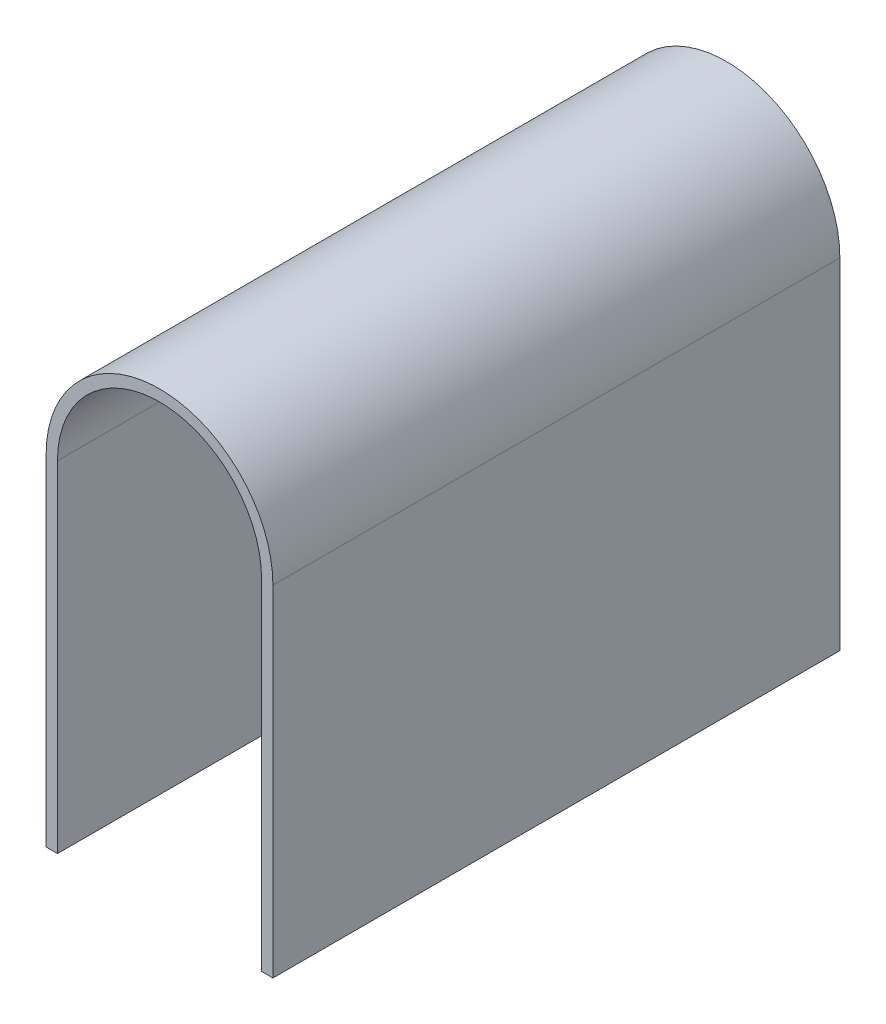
from build123d import *

# Parameters (mm, degrees)
EXTRUSION1_DEPTH = 500


with BuildPart() as part:
    # Esquisse1 → Extrusion1 (new body)
    with BuildSketch(Plane.XY):
        with BuildLine():
            Line((-90, 0), (-90, -300))
            Line((-90, -300), (-100, -300))
            Line((-100, -300), (-100, 0))
            ThreePointArc((-100, 0), (0, 100), (100, 0))
            Line((100, 0), (100, -300))
            Line((100, -300), (90, -300))
            Line((90, -300), (90, 0))
            ThreePointArc((90, 0), (0, 90), (-90, 0))
        make_face()
    extrude(amount=EXTRUSION1_DEPTH)


solid = part.part
